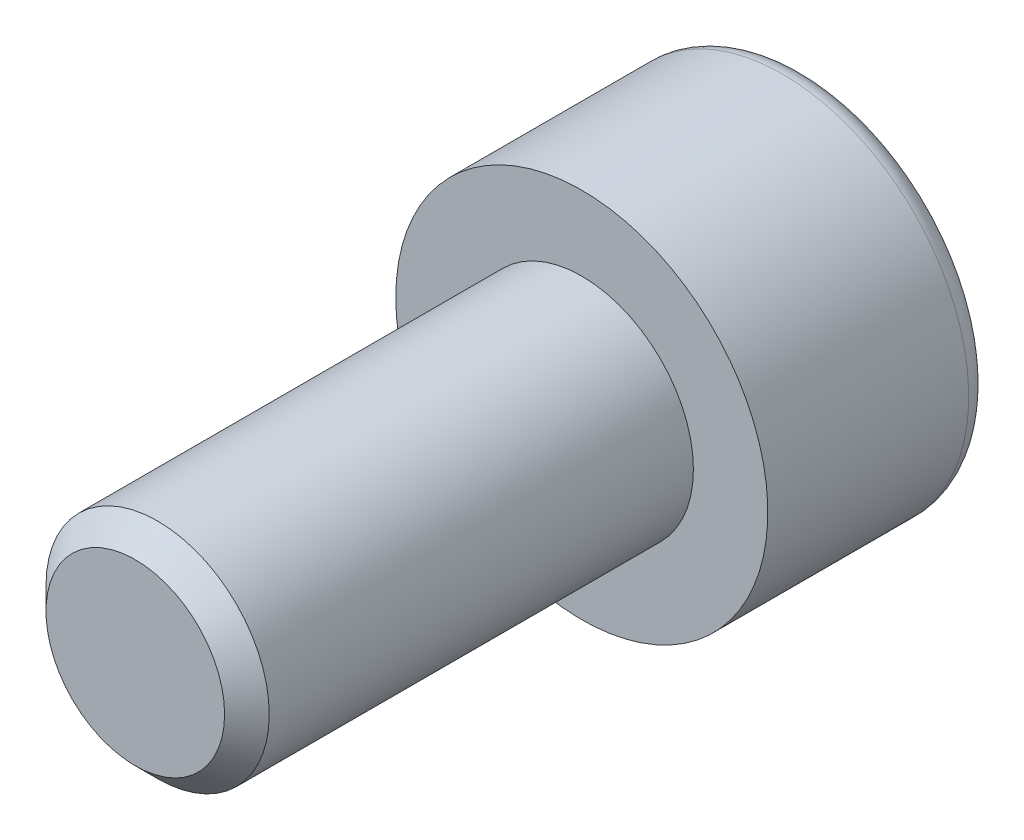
from build123d import *

# Parameters (mm, degrees)
ENLEV_MAT_EXTRU1_DEPTH = 3
ESQUISSE3_W            = 3
ESQUISSE3_H            = 12
CHANFREIN1_SIZE        = 0.6


with BuildPart() as part:
    # Esquisse1 → Base-R_volution (revolve)
    with BuildSketch(Plane(origin=(0, 0, 0), x_dir=(1, 0, 0), z_dir=(0, 1, 0)), mode=Mode.PRIVATE) as base_r_volution_sk:
        with BuildLine():
            Line((0, 0), (5, 0))
            Line((5, 0), (5, 5.4))
            ThreePointArc((5, 5.4), (4.824264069, 5.824264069), (4.4, 6))
            Line((4.4, 6), (0, 6))
            Line((0, 6), (0, 0))
        make_face()
    revolve(base_r_volution_sk.sketch.rotate(Axis((0, 0, 0), (0, 0, -1)), 180), axis=Axis((0, 0, 0), (0, 0, -1)))

    # Esquisse2 → enlev-mat-Extru1 (cut)
    with BuildSketch(Plane.XY.offset(-6)):
        Polygon((2.5, -1.443375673), (2.5, 1.443375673), (0, 2.886751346), (-2.5, 1.443375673), (-2.5, -1.443375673), (0, -2.886751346), align=None)
    extrude(amount=ENLEV_MAT_EXTRU1_DEPTH, mode=Mode.SUBTRACT)

    # Esquisse3 → Boss.-R_vol.1 (revolve)
    with BuildSketch(Plane(origin=(0, 0, 0), x_dir=(1, 0, 0), z_dir=(0, 1, 0))):
        with Locations((1.5, -6)):
            Rectangle(ESQUISSE3_W, ESQUISSE3_H)
    revolve(axis=Axis((0, 0, 0), (0, 0, 1)))

    # Chanfrein1
    chanfrein1_edges = [part.edges().sort_by_distance(p)[0] for p in [
        (-3, 0, 12),
    ]]
    chamfer(chanfrein1_edges, length=CHANFREIN1_SIZE)


solid = part.part
